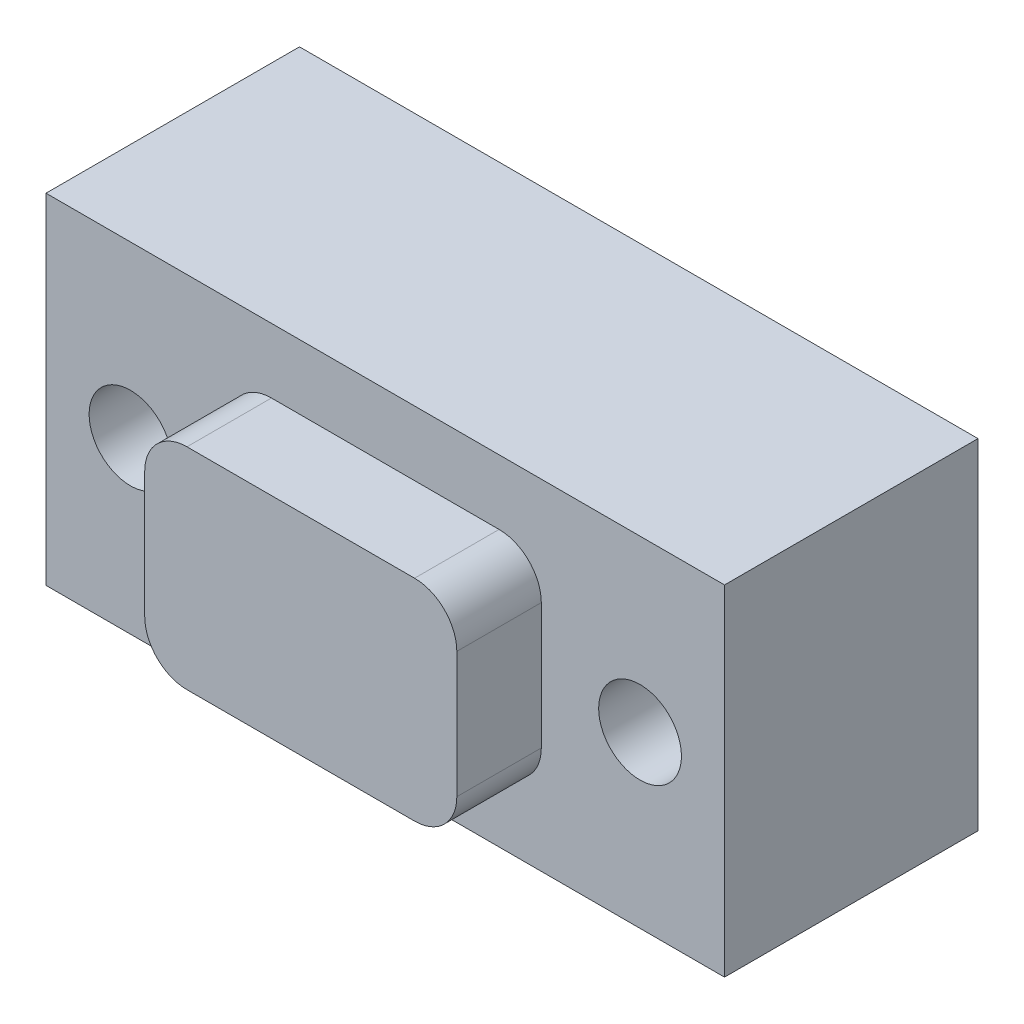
ISO-10303-21;
HEADER;
FILE_DESCRIPTION(('STEP AP214'),'2;1');
FILE_NAME('part.step','',(''),(''),'','','');
FILE_SCHEMA(('AUTOMOTIVE_DESIGN { 1 0 10303 214 1 1 1 1 }'));
ENDSEC;
DATA;
#1=APPLICATION_CONTEXT('core data for automotive mechanical design processes');
#2=APPLICATION_PROTOCOL_DEFINITION('international standard','automotive_design',2000,#1);
#3=PRODUCT_CONTEXT('',#1,'mechanical');
#4=PRODUCT('Part','Part','',(#3));
#5=PRODUCT_RELATED_PRODUCT_CATEGORY('part','',(#4));
#6=PRODUCT_DEFINITION_FORMATION('','',#4);
#7=PRODUCT_DEFINITION_CONTEXT('part definition',#1,'design');
#8=PRODUCT_DEFINITION('design','',#6,#7);
#9=PRODUCT_DEFINITION_SHAPE('','',#8);
#10=(LENGTH_UNIT() NAMED_UNIT(*) SI_UNIT(.MILLI.,.METRE.));
#11=(NAMED_UNIT(*) PLANE_ANGLE_UNIT() SI_UNIT($,.RADIAN.));
#12=(NAMED_UNIT(*) SI_UNIT($,.STERADIAN.) SOLID_ANGLE_UNIT());
#13=UNCERTAINTY_MEASURE_WITH_UNIT(LENGTH_MEASURE(1.E-05),#10,'distance_accuracy_value','');
#14=(GEOMETRIC_REPRESENTATION_CONTEXT(3) GLOBAL_UNCERTAINTY_ASSIGNED_CONTEXT((#13)) GLOBAL_UNIT_ASSIGNED_CONTEXT((#10,
#11,#12)) REPRESENTATION_CONTEXT('',''));
#15=CARTESIAN_POINT('',(0.,0.,0.));
#16=DIRECTION('',(0.,0.,1.));
#17=DIRECTION('',(1.,0.,0.));
#18=AXIS2_PLACEMENT_3D('',#15,#16,#17);
#19=CARTESIAN_POINT('',(0.,0.,0.));
#20=DIRECTION('',(0.,0.,-1.));
#21=DIRECTION('',(-1.,0.,0.));
#22=AXIS2_PLACEMENT_3D('',#19,#20,#21);
#23=PLANE('',#22);
#24=CARTESIAN_POINT('',(7.5057,0.,0.));
#25=DIRECTION('',(0.,0.,-1.));
#26=DIRECTION('',(-1.,0.,0.));
#27=AXIS2_PLACEMENT_3D('',#24,#25,#26);
#28=CIRCLE('',#27,1.21919999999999);
#29=CARTESIAN_POINT('',(6.28650000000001,0.,0.));
#30=VERTEX_POINT('',#29);
#31=EDGE_CURVE('E257',#30,#30,#28,.T.);
#32=ORIENTED_EDGE('',*,*,#31,.T.);
#33=EDGE_LOOP('',(#32));
#34=FACE_BOUND('',#33,.T.);
#35=CARTESIAN_POINT('',(-7.5057,0.,0.));
#36=DIRECTION('',(0.,0.,-1.));
#37=DIRECTION('',(-1.,0.,0.));
#38=AXIS2_PLACEMENT_3D('',#35,#36,#37);
#39=CIRCLE('',#38,1.21919999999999);
#40=CARTESIAN_POINT('',(-8.72489999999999,0.,0.));
#41=VERTEX_POINT('',#40);
#42=EDGE_CURVE('E261',#41,#41,#39,.T.);
#43=ORIENTED_EDGE('',*,*,#42,.T.);
#44=EDGE_LOOP('',(#43));
#45=FACE_BOUND('',#44,.T.);
#46=DIRECTION('',(0.,1.,0.));
#47=VECTOR('',#46,1.);
#48=CARTESIAN_POINT('',(9.9949,-5.0038,0.));
#49=LINE('',#48,#47);
#50=CARTESIAN_POINT('',(9.9949,-5.0038,0.));
#51=VERTEX_POINT('',#50);
#52=CARTESIAN_POINT('',(9.9949,5.0038,0.));
#53=VERTEX_POINT('',#52);
#54=EDGE_CURVE('E146',#51,#53,#49,.T.);
#55=ORIENTED_EDGE('',*,*,#54,.T.);
#56=DIRECTION('',(-1.,0.,0.));
#57=VECTOR('',#56,1.);
#58=CARTESIAN_POINT('',(-9.9949,5.0038,0.));
#59=LINE('',#58,#57);
#60=CARTESIAN_POINT('',(-9.9949,5.0038,0.));
#61=VERTEX_POINT('',#60);
#62=EDGE_CURVE('E149',#53,#61,#59,.T.);
#63=ORIENTED_EDGE('',*,*,#62,.T.);
#64=DIRECTION('',(0.,-1.,0.));
#65=VECTOR('',#64,1.);
#66=CARTESIAN_POINT('',(-9.9949,-5.0038,0.));
#67=LINE('',#66,#65);
#68=CARTESIAN_POINT('',(-9.9949,-5.0038,0.));
#69=VERTEX_POINT('',#68);
#70=EDGE_CURVE('E170',#61,#69,#67,.T.);
#71=ORIENTED_EDGE('',*,*,#70,.T.);
#72=DIRECTION('',(1.,0.,0.));
#73=VECTOR('',#72,1.);
#74=CARTESIAN_POINT('',(-9.9949,-5.0038,0.));
#75=LINE('',#74,#73);
#76=EDGE_CURVE('E159',#69,#51,#75,.T.);
#77=ORIENTED_EDGE('',*,*,#76,.T.);
#78=EDGE_LOOP('',(#55,#63,#71,#77));
#79=FACE_BOUND('',#78,.T.);
#80=CARTESIAN_POINT('',(3.3528,1.8542,0.));
#81=DIRECTION('',(0.,0.,1.));
#82=DIRECTION('',(1.,0.,0.));
#83=AXIS2_PLACEMENT_3D('',#80,#81,#82);
#84=CIRCLE('',#83,1.2446);
#85=CARTESIAN_POINT('',(4.5974,1.85419999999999,0.));
#86=VERTEX_POINT('',#85);
#87=CARTESIAN_POINT('',(3.35279999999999,3.0988,0.));
#88=VERTEX_POINT('',#87);
#89=EDGE_CURVE('E145',#86,#88,#84,.T.);
#90=ORIENTED_EDGE('',*,*,#89,.F.);
#91=DIRECTION('',(0.,1.,0.));
#92=VECTOR('',#91,1.);
#93=CARTESIAN_POINT('',(4.5974,-1.85419999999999,0.));
#94=LINE('',#93,#92);
#95=CARTESIAN_POINT('',(4.5974,-1.85419999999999,0.));
#96=VERTEX_POINT('',#95);
#97=EDGE_CURVE('E142',#96,#86,#94,.T.);
#98=ORIENTED_EDGE('',*,*,#97,.F.);
#99=CARTESIAN_POINT('',(3.3528,-1.8542,0.));
#100=DIRECTION('',(0.,0.,1.));
#101=DIRECTION('',(1.,0.,0.));
#102=AXIS2_PLACEMENT_3D('',#99,#100,#101);
#103=CIRCLE('',#102,1.2446);
#104=CARTESIAN_POINT('',(3.35279999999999,-3.0988,0.));
#105=VERTEX_POINT('',#104);
#106=EDGE_CURVE('E290',#105,#96,#103,.T.);
#107=ORIENTED_EDGE('',*,*,#106,.F.);
#108=DIRECTION('',(1.,0.,0.));
#109=VECTOR('',#108,1.);
#110=CARTESIAN_POINT('',(-3.35279999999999,-3.0988,0.));
#111=LINE('',#110,#109);
#112=CARTESIAN_POINT('',(-3.35279999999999,-3.0988,0.));
#113=VERTEX_POINT('',#112);
#114=EDGE_CURVE('E287',#113,#105,#111,.T.);
#115=ORIENTED_EDGE('',*,*,#114,.F.);
#116=CARTESIAN_POINT('',(-3.3528,-1.8542,0.));
#117=DIRECTION('',(0.,0.,1.));
#118=DIRECTION('',(-1.,0.,0.));
#119=AXIS2_PLACEMENT_3D('',#116,#117,#118);
#120=CIRCLE('',#119,1.2446);
#121=CARTESIAN_POINT('',(-4.5974,-1.8542,0.));
#122=VERTEX_POINT('',#121);
#123=EDGE_CURVE('E284',#122,#113,#120,.T.);
#124=ORIENTED_EDGE('',*,*,#123,.F.);
#125=DIRECTION('',(0.,-1.,0.));
#126=VECTOR('',#125,1.);
#127=CARTESIAN_POINT('',(-4.5974,-1.85419999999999,0.));
#128=LINE('',#127,#126);
#129=CARTESIAN_POINT('',(-4.5974,1.85419999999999,0.));
#130=VERTEX_POINT('',#129);
#131=EDGE_CURVE('E281',#130,#122,#128,.T.);
#132=ORIENTED_EDGE('',*,*,#131,.F.);
#133=CARTESIAN_POINT('',(-3.3528,1.8542,0.));
#134=DIRECTION('',(0.,0.,1.));
#135=DIRECTION('',(1.,0.,0.));
#136=AXIS2_PLACEMENT_3D('',#133,#134,#135);
#137=CIRCLE('',#136,1.2446);
#138=CARTESIAN_POINT('',(-3.35279999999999,3.0988,0.));
#139=VERTEX_POINT('',#138);
#140=EDGE_CURVE('E57',#139,#130,#137,.T.);
#141=ORIENTED_EDGE('',*,*,#140,.F.);
#142=DIRECTION('',(-1.,0.,0.));
#143=VECTOR('',#142,1.);
#144=CARTESIAN_POINT('',(-3.35279999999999,3.0988,0.));
#145=LINE('',#144,#143);
#146=EDGE_CURVE('E52',#88,#139,#145,.T.);
#147=ORIENTED_EDGE('',*,*,#146,.F.);
#148=EDGE_LOOP('',(#90,#98,#107,#115,#124,#132,#141,#147));
#149=FACE_BOUND('',#148,.T.);
#150=ADVANCED_FACE('F35',(#34,#45,#79,#149),#23,.F.);
#151=CARTESIAN_POINT('',(9.9949,-5.0038,-7.4676));
#152=DIRECTION('',(1.,0.,0.));
#153=DIRECTION('',(0.,0.,-1.));
#154=AXIS2_PLACEMENT_3D('',#151,#152,#153);
#155=PLANE('',#154);
#156=ORIENTED_EDGE('',*,*,#54,.F.);
#157=DIRECTION('',(0.,0.,1.));
#158=VECTOR('',#157,1.);
#159=CARTESIAN_POINT('',(9.9949,-5.0038,-7.4676));
#160=LINE('',#159,#158);
#161=CARTESIAN_POINT('',(9.9949,-5.0038,-7.4676));
#162=VERTEX_POINT('',#161);
#163=EDGE_CURVE('E11',#162,#51,#160,.T.);
#164=ORIENTED_EDGE('',*,*,#163,.F.);
#165=DIRECTION('',(0.,1.,0.));
#166=VECTOR('',#165,1.);
#167=CARTESIAN_POINT('',(9.9949,-5.0038,-7.4676));
#168=LINE('',#167,#166);
#169=CARTESIAN_POINT('',(9.9949,5.0038,-7.4676));
#170=VERTEX_POINT('',#169);
#171=EDGE_CURVE('E155',#162,#170,#168,.T.);
#172=ORIENTED_EDGE('',*,*,#171,.T.);
#173=DIRECTION('',(0.,0.,1.));
#174=VECTOR('',#173,1.);
#175=CARTESIAN_POINT('',(9.9949,5.0038,-7.4676));
#176=LINE('',#175,#174);
#177=EDGE_CURVE('E39',#170,#53,#176,.T.);
#178=ORIENTED_EDGE('',*,*,#177,.T.);
#179=EDGE_LOOP('',(#156,#164,#172,#178));
#180=FACE_BOUND('',#179,.T.);
#181=ADVANCED_FACE('F37',(#180),#155,.T.);
#182=CARTESIAN_POINT('',(-9.9949,-5.0038,-7.4676));
#183=DIRECTION('',(0.,-1.,0.));
#184=DIRECTION('',(0.,0.,-1.));
#185=AXIS2_PLACEMENT_3D('',#182,#183,#184);
#186=PLANE('',#185);
#187=ORIENTED_EDGE('',*,*,#76,.F.);
#188=DIRECTION('',(0.,0.,1.));
#189=VECTOR('',#188,1.);
#190=CARTESIAN_POINT('',(-9.9949,-5.0038,-7.4676));
#191=LINE('',#190,#189);
#192=CARTESIAN_POINT('',(-9.9949,-5.0038,-7.4676));
#193=VERTEX_POINT('',#192);
#194=EDGE_CURVE('E44',#193,#69,#191,.T.);
#195=ORIENTED_EDGE('',*,*,#194,.F.);
#196=DIRECTION('',(1.,0.,0.));
#197=VECTOR('',#196,1.);
#198=CARTESIAN_POINT('',(-9.9949,-5.0038,-7.4676));
#199=LINE('',#198,#197);
#200=EDGE_CURVE('E165',#193,#162,#199,.T.);
#201=ORIENTED_EDGE('',*,*,#200,.T.);
#202=ORIENTED_EDGE('',*,*,#163,.T.);
#203=EDGE_LOOP('',(#187,#195,#201,#202));
#204=FACE_BOUND('',#203,.T.);
#205=ADVANCED_FACE('F187',(#204),#186,.T.);
#206=CARTESIAN_POINT('',(-9.9949,-5.0038,-7.4676));
#207=DIRECTION('',(-1.,0.,0.));
#208=DIRECTION('',(0.,0.,1.));
#209=AXIS2_PLACEMENT_3D('',#206,#207,#208);
#210=PLANE('',#209);
#211=ORIENTED_EDGE('',*,*,#70,.F.);
#212=DIRECTION('',(0.,0.,1.));
#213=VECTOR('',#212,1.);
#214=CARTESIAN_POINT('',(-9.9949,5.0038,-7.4676));
#215=LINE('',#214,#213);
#216=CARTESIAN_POINT('',(-9.9949,5.0038,-7.4676));
#217=VERTEX_POINT('',#216);
#218=EDGE_CURVE('E175',#217,#61,#215,.T.);
#219=ORIENTED_EDGE('',*,*,#218,.F.);
#220=DIRECTION('',(0.,-1.,0.));
#221=VECTOR('',#220,1.);
#222=CARTESIAN_POINT('',(-9.9949,-5.0038,-7.4676));
#223=LINE('',#222,#221);
#224=EDGE_CURVE('E162',#217,#193,#223,.T.);
#225=ORIENTED_EDGE('',*,*,#224,.T.);
#226=ORIENTED_EDGE('',*,*,#194,.T.);
#227=EDGE_LOOP('',(#211,#219,#225,#226));
#228=FACE_BOUND('',#227,.T.);
#229=ADVANCED_FACE('F193',(#228),#210,.T.);
#230=CARTESIAN_POINT('',(-9.9949,5.0038,-7.4676));
#231=DIRECTION('',(0.,1.,0.));
#232=DIRECTION('',(0.,0.,1.));
#233=AXIS2_PLACEMENT_3D('',#230,#231,#232);
#234=PLANE('',#233);
#235=ORIENTED_EDGE('',*,*,#62,.F.);
#236=ORIENTED_EDGE('',*,*,#177,.F.);
#237=DIRECTION('',(-1.,0.,0.));
#238=VECTOR('',#237,1.);
#239=CARTESIAN_POINT('',(-9.9949,5.0038,-7.4676));
#240=LINE('',#239,#238);
#241=EDGE_CURVE('E158',#170,#217,#240,.T.);
#242=ORIENTED_EDGE('',*,*,#241,.T.);
#243=ORIENTED_EDGE('',*,*,#218,.T.);
#244=EDGE_LOOP('',(#235,#236,#242,#243));
#245=FACE_BOUND('',#244,.T.);
#246=ADVANCED_FACE('F183',(#245),#234,.T.);
#247=CARTESIAN_POINT('',(0.,0.,-7.4676));
#248=DIRECTION('',(0.,0.,-1.));
#249=DIRECTION('',(-1.,0.,0.));
#250=AXIS2_PLACEMENT_3D('',#247,#248,#249);
#251=PLANE('',#250);
#252=CARTESIAN_POINT('',(7.5057,0.,-7.4676));
#253=DIRECTION('',(0.,0.,-1.));
#254=DIRECTION('',(-1.,0.,0.));
#255=AXIS2_PLACEMENT_3D('',#252,#253,#254);
#256=CIRCLE('',#255,1.21919999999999);
#257=CARTESIAN_POINT('',(6.28650000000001,0.,-7.4676));
#258=VERTEX_POINT('',#257);
#259=EDGE_CURVE('E255',#258,#258,#256,.T.);
#260=ORIENTED_EDGE('',*,*,#259,.F.);
#261=EDGE_LOOP('',(#260));
#262=FACE_BOUND('',#261,.T.);
#263=CARTESIAN_POINT('',(-7.5057,0.,-7.4676));
#264=DIRECTION('',(0.,0.,-1.));
#265=DIRECTION('',(-1.,0.,0.));
#266=AXIS2_PLACEMENT_3D('',#263,#264,#265);
#267=CIRCLE('',#266,1.21919999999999);
#268=CARTESIAN_POINT('',(-8.72489999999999,0.,-7.4676));
#269=VERTEX_POINT('',#268);
#270=EDGE_CURVE('E258',#269,#269,#267,.T.);
#271=ORIENTED_EDGE('',*,*,#270,.F.);
#272=EDGE_LOOP('',(#271));
#273=FACE_BOUND('',#272,.T.);
#274=ORIENTED_EDGE('',*,*,#171,.F.);
#275=ORIENTED_EDGE('',*,*,#200,.F.);
#276=ORIENTED_EDGE('',*,*,#224,.F.);
#277=ORIENTED_EDGE('',*,*,#241,.F.);
#278=EDGE_LOOP('',(#274,#275,#276,#277));
#279=FACE_BOUND('',#278,.T.);
#280=ADVANCED_FACE('F190',(#262,#273,#279),#251,.T.);
#281=CARTESIAN_POINT('',(3.3528,1.8542,2.4892));
#282=DIRECTION('',(0.,0.,-1.));
#283=DIRECTION('',(-1.,0.,0.));
#284=AXIS2_PLACEMENT_3D('',#281,#282,#283);
#285=CYLINDRICAL_SURFACE('',#284,1.2446);
#286=ORIENTED_EDGE('',*,*,#89,.T.);
#287=DIRECTION('',(0.,0.,-1.));
#288=VECTOR('',#287,1.);
#289=CARTESIAN_POINT('',(3.35279999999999,3.0988,2.4892));
#290=LINE('',#289,#288);
#291=CARTESIAN_POINT('',(3.35279999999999,3.0988,2.4892));
#292=VERTEX_POINT('',#291);
#293=EDGE_CURVE('E126',#292,#88,#290,.T.);
#294=ORIENTED_EDGE('',*,*,#293,.F.);
#295=CARTESIAN_POINT('',(3.3528,1.8542,2.4892));
#296=DIRECTION('',(0.,0.,1.));
#297=DIRECTION('',(1.,0.,0.));
#298=AXIS2_PLACEMENT_3D('',#295,#296,#297);
#299=CIRCLE('',#298,1.2446);
#300=CARTESIAN_POINT('',(4.5974,1.85419999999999,2.4892));
#301=VERTEX_POINT('',#300);
#302=EDGE_CURVE('E133',#301,#292,#299,.T.);
#303=ORIENTED_EDGE('',*,*,#302,.F.);
#304=DIRECTION('',(0.,0.,-1.));
#305=VECTOR('',#304,1.);
#306=CARTESIAN_POINT('',(4.5974,1.85419999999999,2.4892));
#307=LINE('',#306,#305);
#308=EDGE_CURVE('E277',#301,#86,#307,.T.);
#309=ORIENTED_EDGE('',*,*,#308,.T.);
#310=EDGE_LOOP('',(#286,#294,#303,#309));
#311=FACE_BOUND('',#310,.T.);
#312=ADVANCED_FACE('F144',(#311),#285,.T.);
#313=CARTESIAN_POINT('',(-3.35279999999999,3.0988,2.4892));
#314=DIRECTION('',(0.,-1.,0.));
#315=DIRECTION('',(0.,0.,-1.));
#316=AXIS2_PLACEMENT_3D('',#313,#314,#315);
#317=PLANE('',#316);
#318=ORIENTED_EDGE('',*,*,#146,.T.);
#319=DIRECTION('',(0.,0.,-1.));
#320=VECTOR('',#319,1.);
#321=CARTESIAN_POINT('',(-3.35279999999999,3.0988,2.4892));
#322=LINE('',#321,#320);
#323=CARTESIAN_POINT('',(-3.35279999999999,3.0988,2.4892));
#324=VERTEX_POINT('',#323);
#325=EDGE_CURVE('E129',#324,#139,#322,.T.);
#326=ORIENTED_EDGE('',*,*,#325,.F.);
#327=DIRECTION('',(-1.,0.,0.));
#328=VECTOR('',#327,1.);
#329=CARTESIAN_POINT('',(-3.35279999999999,3.0988,2.4892));
#330=LINE('',#329,#328);
#331=EDGE_CURVE('E122',#292,#324,#330,.T.);
#332=ORIENTED_EDGE('',*,*,#331,.F.);
#333=ORIENTED_EDGE('',*,*,#293,.T.);
#334=EDGE_LOOP('',(#318,#326,#332,#333));
#335=FACE_BOUND('',#334,.T.);
#336=ADVANCED_FACE('F124',(#335),#317,.F.);
#337=CARTESIAN_POINT('',(-3.3528,1.8542,2.4892));
#338=DIRECTION('',(0.,0.,-1.));
#339=DIRECTION('',(-1.,0.,0.));
#340=AXIS2_PLACEMENT_3D('',#337,#338,#339);
#341=CYLINDRICAL_SURFACE('',#340,1.2446);
#342=ORIENTED_EDGE('',*,*,#140,.T.);
#343=DIRECTION('',(0.,0.,-1.));
#344=VECTOR('',#343,1.);
#345=CARTESIAN_POINT('',(-4.5974,1.85419999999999,2.4892));
#346=LINE('',#345,#344);
#347=CARTESIAN_POINT('',(-4.5974,1.85419999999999,2.4892));
#348=VERTEX_POINT('',#347);
#349=EDGE_CURVE('E151',#348,#130,#346,.T.);
#350=ORIENTED_EDGE('',*,*,#349,.F.);
#351=CARTESIAN_POINT('',(-3.3528,1.8542,2.4892));
#352=DIRECTION('',(0.,0.,1.));
#353=DIRECTION('',(1.,0.,0.));
#354=AXIS2_PLACEMENT_3D('',#351,#352,#353);
#355=CIRCLE('',#354,1.2446);
#356=EDGE_CURVE('E132',#324,#348,#355,.T.);
#357=ORIENTED_EDGE('',*,*,#356,.F.);
#358=ORIENTED_EDGE('',*,*,#325,.T.);
#359=EDGE_LOOP('',(#342,#350,#357,#358));
#360=FACE_BOUND('',#359,.T.);
#361=ADVANCED_FACE('F217',(#360),#341,.T.);
#362=CARTESIAN_POINT('',(-4.5974,-1.85419999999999,2.4892));
#363=DIRECTION('',(1.,0.,0.));
#364=DIRECTION('',(0.,0.,-1.));
#365=AXIS2_PLACEMENT_3D('',#362,#363,#364);
#366=PLANE('',#365);
#367=ORIENTED_EDGE('',*,*,#131,.T.);
#368=DIRECTION('',(0.,0.,-1.));
#369=VECTOR('',#368,1.);
#370=CARTESIAN_POINT('',(-4.5974,-1.85419999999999,2.4892));
#371=LINE('',#370,#369);
#372=CARTESIAN_POINT('',(-4.5974,-1.85419999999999,2.4892));
#373=VERTEX_POINT('',#372);
#374=EDGE_CURVE('E305',#373,#122,#371,.T.);
#375=ORIENTED_EDGE('',*,*,#374,.F.);
#376=DIRECTION('',(0.,-1.,0.));
#377=VECTOR('',#376,1.);
#378=CARTESIAN_POINT('',(-4.5974,-1.85419999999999,2.4892));
#379=LINE('',#378,#377);
#380=EDGE_CURVE('E268',#348,#373,#379,.T.);
#381=ORIENTED_EDGE('',*,*,#380,.F.);
#382=ORIENTED_EDGE('',*,*,#349,.T.);
#383=EDGE_LOOP('',(#367,#375,#381,#382));
#384=FACE_BOUND('',#383,.T.);
#385=ADVANCED_FACE('F220',(#384),#366,.F.);
#386=CARTESIAN_POINT('',(-3.3528,-1.8542,2.4892));
#387=DIRECTION('',(0.,0.,-1.));
#388=DIRECTION('',(-1.,0.,0.));
#389=AXIS2_PLACEMENT_3D('',#386,#387,#388);
#390=CYLINDRICAL_SURFACE('',#389,1.2446);
#391=ORIENTED_EDGE('',*,*,#123,.T.);
#392=DIRECTION('',(0.,0.,-1.));
#393=VECTOR('',#392,1.);
#394=CARTESIAN_POINT('',(-3.35279999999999,-3.0988,2.4892));
#395=LINE('',#394,#393);
#396=CARTESIAN_POINT('',(-3.35279999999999,-3.0988,2.4892));
#397=VERTEX_POINT('',#396);
#398=EDGE_CURVE('E302',#397,#113,#395,.T.);
#399=ORIENTED_EDGE('',*,*,#398,.F.);
#400=CARTESIAN_POINT('',(-3.3528,-1.8542,2.4892));
#401=DIRECTION('',(0.,0.,1.));
#402=DIRECTION('',(-1.,0.,0.));
#403=AXIS2_PLACEMENT_3D('',#400,#401,#402);
#404=CIRCLE('',#403,1.2446);
#405=EDGE_CURVE('E270',#373,#397,#404,.T.);
#406=ORIENTED_EDGE('',*,*,#405,.F.);
#407=ORIENTED_EDGE('',*,*,#374,.T.);
#408=EDGE_LOOP('',(#391,#399,#406,#407));
#409=FACE_BOUND('',#408,.T.);
#410=ADVANCED_FACE('F224',(#409),#390,.T.);
#411=CARTESIAN_POINT('',(-3.35279999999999,-3.0988,2.4892));
#412=DIRECTION('',(0.,1.,0.));
#413=DIRECTION('',(0.,0.,1.));
#414=AXIS2_PLACEMENT_3D('',#411,#412,#413);
#415=PLANE('',#414);
#416=ORIENTED_EDGE('',*,*,#114,.T.);
#417=DIRECTION('',(0.,0.,-1.));
#418=VECTOR('',#417,1.);
#419=CARTESIAN_POINT('',(3.35279999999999,-3.0988,2.4892));
#420=LINE('',#419,#418);
#421=CARTESIAN_POINT('',(3.35279999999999,-3.0988,2.4892));
#422=VERTEX_POINT('',#421);
#423=EDGE_CURVE('E299',#422,#105,#420,.T.);
#424=ORIENTED_EDGE('',*,*,#423,.F.);
#425=DIRECTION('',(1.,0.,0.));
#426=VECTOR('',#425,1.);
#427=CARTESIAN_POINT('',(-3.35279999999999,-3.0988,2.4892));
#428=LINE('',#427,#426);
#429=EDGE_CURVE('E272',#397,#422,#428,.T.);
#430=ORIENTED_EDGE('',*,*,#429,.F.);
#431=ORIENTED_EDGE('',*,*,#398,.T.);
#432=EDGE_LOOP('',(#416,#424,#430,#431));
#433=FACE_BOUND('',#432,.T.);
#434=ADVANCED_FACE('F228',(#433),#415,.F.);
#435=CARTESIAN_POINT('',(3.3528,-1.8542,2.4892));
#436=DIRECTION('',(0.,0.,-1.));
#437=DIRECTION('',(-1.,0.,0.));
#438=AXIS2_PLACEMENT_3D('',#435,#436,#437);
#439=CYLINDRICAL_SURFACE('',#438,1.2446);
#440=ORIENTED_EDGE('',*,*,#106,.T.);
#441=DIRECTION('',(0.,0.,-1.));
#442=VECTOR('',#441,1.);
#443=CARTESIAN_POINT('',(4.5974,-1.85419999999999,2.4892));
#444=LINE('',#443,#442);
#445=CARTESIAN_POINT('',(4.5974,-1.85419999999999,2.4892));
#446=VERTEX_POINT('',#445);
#447=EDGE_CURVE('E296',#446,#96,#444,.T.);
#448=ORIENTED_EDGE('',*,*,#447,.F.);
#449=CARTESIAN_POINT('',(3.3528,-1.8542,2.4892));
#450=DIRECTION('',(0.,0.,1.));
#451=DIRECTION('',(1.,0.,0.));
#452=AXIS2_PLACEMENT_3D('',#449,#450,#451);
#453=CIRCLE('',#452,1.2446);
#454=EDGE_CURVE('E274',#422,#446,#453,.T.);
#455=ORIENTED_EDGE('',*,*,#454,.F.);
#456=ORIENTED_EDGE('',*,*,#423,.T.);
#457=EDGE_LOOP('',(#440,#448,#455,#456));
#458=FACE_BOUND('',#457,.T.);
#459=ADVANCED_FACE('F232',(#458),#439,.T.);
#460=CARTESIAN_POINT('',(4.5974,-1.85419999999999,2.4892));
#461=DIRECTION('',(-1.,0.,0.));
#462=DIRECTION('',(0.,0.,1.));
#463=AXIS2_PLACEMENT_3D('',#460,#461,#462);
#464=PLANE('',#463);
#465=ORIENTED_EDGE('',*,*,#97,.T.);
#466=ORIENTED_EDGE('',*,*,#308,.F.);
#467=DIRECTION('',(0.,1.,0.));
#468=VECTOR('',#467,1.);
#469=CARTESIAN_POINT('',(4.5974,-1.85419999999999,2.4892));
#470=LINE('',#469,#468);
#471=EDGE_CURVE('E138',#446,#301,#470,.T.);
#472=ORIENTED_EDGE('',*,*,#471,.F.);
#473=ORIENTED_EDGE('',*,*,#447,.T.);
#474=EDGE_LOOP('',(#465,#466,#472,#473));
#475=FACE_BOUND('',#474,.T.);
#476=ADVANCED_FACE('F236',(#475),#464,.F.);
#477=CARTESIAN_POINT('',(3.3528,1.8542,2.4892));
#478=DIRECTION('',(0.,0.,1.));
#479=DIRECTION('',(1.,0.,0.));
#480=AXIS2_PLACEMENT_3D('',#477,#478,#479);
#481=PLANE('',#480);
#482=ORIENTED_EDGE('',*,*,#302,.T.);
#483=ORIENTED_EDGE('',*,*,#331,.T.);
#484=ORIENTED_EDGE('',*,*,#356,.T.);
#485=ORIENTED_EDGE('',*,*,#380,.T.);
#486=ORIENTED_EDGE('',*,*,#405,.T.);
#487=ORIENTED_EDGE('',*,*,#429,.T.);
#488=ORIENTED_EDGE('',*,*,#454,.T.);
#489=ORIENTED_EDGE('',*,*,#471,.T.);
#490=EDGE_LOOP('',(#482,#483,#484,#485,#486,#487,#488,#489));
#491=FACE_BOUND('',#490,.T.);
#492=ADVANCED_FACE('F136',(#491),#481,.T.);
#493=CARTESIAN_POINT('',(-7.5057,0.,-7.4676));
#494=DIRECTION('',(0.,0.,-1.));
#495=DIRECTION('',(-1.,0.,0.));
#496=AXIS2_PLACEMENT_3D('',#493,#494,#495);
#497=CYLINDRICAL_SURFACE('',#496,1.21919999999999);
#498=ORIENTED_EDGE('',*,*,#270,.T.);
#499=EDGE_LOOP('',(#498));
#500=FACE_BOUND('',#499,.T.);
#501=ORIENTED_EDGE('',*,*,#42,.F.);
#502=EDGE_LOOP('',(#501));
#503=FACE_BOUND('',#502,.T.);
#504=ADVANCED_FACE('F243',(#500,#503),#497,.F.);
#505=CARTESIAN_POINT('',(7.5057,0.,-7.4676));
#506=DIRECTION('',(0.,0.,-1.));
#507=DIRECTION('',(-1.,0.,0.));
#508=AXIS2_PLACEMENT_3D('',#505,#506,#507);
#509=CYLINDRICAL_SURFACE('',#508,1.21919999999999);
#510=ORIENTED_EDGE('',*,*,#259,.T.);
#511=EDGE_LOOP('',(#510));
#512=FACE_BOUND('',#511,.T.);
#513=ORIENTED_EDGE('',*,*,#31,.F.);
#514=EDGE_LOOP('',(#513));
#515=FACE_BOUND('',#514,.T.);
#516=ADVANCED_FACE('F246',(#512,#515),#509,.F.);
#517=CLOSED_SHELL('',(#150,#181,#205,#229,#246,#280,#312,#336,#361,#385,#410,#434,#459,#476,
#492,#504,#516));
#518=MANIFOLD_SOLID_BREP('B2',#517);
#519=ADVANCED_BREP_SHAPE_REPRESENTATION('',(#18,#518),#14);
#520=SHAPE_DEFINITION_REPRESENTATION(#9,#519);
ENDSEC;
END-ISO-10303-21;
